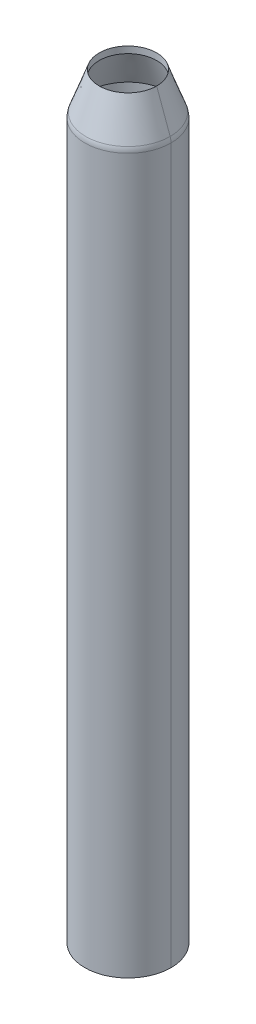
ISO-10303-21;
HEADER;
FILE_DESCRIPTION(('STEP AP214'),'2;1');
FILE_NAME('part.step','',(''),(''),'','','');
FILE_SCHEMA(('AUTOMOTIVE_DESIGN { 1 0 10303 214 1 1 1 1 }'));
ENDSEC;
DATA;
#1=APPLICATION_CONTEXT('core data for automotive mechanical design processes');
#2=APPLICATION_PROTOCOL_DEFINITION('international standard','automotive_design',2000,#1);
#3=PRODUCT_CONTEXT('',#1,'mechanical');
#4=PRODUCT('Part','Part','',(#3));
#5=PRODUCT_RELATED_PRODUCT_CATEGORY('part','',(#4));
#6=PRODUCT_DEFINITION_FORMATION('','',#4);
#7=PRODUCT_DEFINITION_CONTEXT('part definition',#1,'design');
#8=PRODUCT_DEFINITION('design','',#6,#7);
#9=PRODUCT_DEFINITION_SHAPE('','',#8);
#10=(LENGTH_UNIT() NAMED_UNIT(*) SI_UNIT(.MILLI.,.METRE.));
#11=(NAMED_UNIT(*) PLANE_ANGLE_UNIT() SI_UNIT($,.RADIAN.));
#12=(NAMED_UNIT(*) SI_UNIT($,.STERADIAN.) SOLID_ANGLE_UNIT());
#13=UNCERTAINTY_MEASURE_WITH_UNIT(LENGTH_MEASURE(1.E-05),#10,'distance_accuracy_value','');
#14=(GEOMETRIC_REPRESENTATION_CONTEXT(3) GLOBAL_UNCERTAINTY_ASSIGNED_CONTEXT((#13)) GLOBAL_UNIT_ASSIGNED_CONTEXT((#10,
#11,#12)) REPRESENTATION_CONTEXT('',''));
#15=CARTESIAN_POINT('',(0.,0.,0.));
#16=DIRECTION('',(0.,0.,1.));
#17=DIRECTION('',(1.,0.,0.));
#18=AXIS2_PLACEMENT_3D('',#15,#16,#17);
#19=CARTESIAN_POINT('',(0.,3115.53993403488,0.));
#20=DIRECTION('',(0.,1.,0.));
#21=DIRECTION('',(-1.,0.,0.));
#22=AXIS2_PLACEMENT_3D('',#19,#20,#21);
#23=CYLINDRICAL_SURFACE('',#22,57.);
#24=DIRECTION('',(0.,1.,0.));
#25=VECTOR('',#24,1.);
#26=CARTESIAN_POINT('',(40.0000000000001,3115.53993403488,-40.6078810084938));
#27=LINE('',#26,#25);
#28=CARTESIAN_POINT('',(40.0000000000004,850.,-40.6078810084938));
#29=VERTEX_POINT('',#28);
#30=CARTESIAN_POINT('',(40.0000000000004,530.,-40.6078810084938));
#31=VERTEX_POINT('',#30);
#32=EDGE_CURVE('E170',#29,#31,#27,.F.);
#33=ORIENTED_EDGE('',*,*,#32,.F.);
#34=CARTESIAN_POINT('',(-39.9999999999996,850.,-40.607881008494));
#35=CARTESIAN_POINT('',(-40.0000187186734,850.483392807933,-40.6078393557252));
#36=CARTESIAN_POINT('',(-39.9912379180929,850.966768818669,-40.616511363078));
#37=CARTESIAN_POINT('',(-39.9562189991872,851.932219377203,-40.6509737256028));
#38=CARTESIAN_POINT('',(-39.9299830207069,852.414294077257,-40.6767619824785));
#39=CARTESIAN_POINT('',(-39.8602501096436,853.375239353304,-40.7450944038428));
#40=CARTESIAN_POINT('',(-39.8167803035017,853.854113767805,-40.7876122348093));
#41=CARTESIAN_POINT('',(-39.7128568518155,854.808265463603,-40.8888030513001));
#42=CARTESIAN_POINT('',(-39.6524028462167,855.28354266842,-40.9474763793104));
#43=CARTESIAN_POINT('',(-39.4475653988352,856.691955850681,-41.1451803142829));
#44=CARTESIAN_POINT('',(-39.2789000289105,857.61858839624,-41.3067025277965));
#45=CARTESIAN_POINT('',(-38.8796024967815,859.447415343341,-41.6827454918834));
#46=CARTESIAN_POINT('',(-38.6489482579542,860.349600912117,-41.8972851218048));
#47=CARTESIAN_POINT('',(-38.1309075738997,862.119350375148,-42.369278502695));
#48=CARTESIAN_POINT('',(-37.8438853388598,862.987095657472,-42.6264551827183));
#49=CARTESIAN_POINT('',(-37.2155911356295,864.690964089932,-43.1760796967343));
#50=CARTESIAN_POINT('',(-36.8743227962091,865.527089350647,-43.4685251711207));
#51=CARTESIAN_POINT('',(-36.139339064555,867.168555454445,-44.0814901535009));
#52=CARTESIAN_POINT('',(-35.7454693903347,867.97379641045,-44.4020912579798));
#53=CARTESIAN_POINT('',(-34.9084548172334,869.549836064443,-45.0631142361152));
#54=CARTESIAN_POINT('',(-34.4653029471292,870.320629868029,-45.403538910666));
#55=CARTESIAN_POINT('',(-33.4500380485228,871.958566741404,-46.1580072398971));
#56=CARTESIAN_POINT('',(-32.8689226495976,872.819003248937,-46.5745186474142));
#57=CARTESIAN_POINT('',(-31.6437412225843,874.489729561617,-47.4154606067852));
#58=CARTESIAN_POINT('',(-30.9996706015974,875.300015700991,-47.839891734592));
#59=CARTESIAN_POINT('',(-29.6500849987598,876.869009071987,-48.6878615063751));
#60=CARTESIAN_POINT('',(-28.9445410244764,877.627691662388,-49.1113996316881));
#61=CARTESIAN_POINT('',(-27.4738156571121,879.090638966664,-49.949031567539));
#62=CARTESIAN_POINT('',(-26.7086301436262,879.794899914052,-50.363124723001));
#63=CARTESIAN_POINT('',(-24.9864198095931,881.259605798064,-51.2422113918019));
#64=CARTESIAN_POINT('',(-24.018788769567,882.009540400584,-51.7040334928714));
#65=CARTESIAN_POINT('',(-22.0071335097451,883.424506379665,-52.5917692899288));
#66=CARTESIAN_POINT('',(-20.9630951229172,884.089521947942,-53.0176762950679));
#67=CARTESIAN_POINT('',(-19.3446920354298,885.016697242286,-53.6200919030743));
#68=CARTESIAN_POINT('',(-18.7968250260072,885.31388262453,-53.8147230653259));
#69=CARTESIAN_POINT('',(-17.6841574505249,885.883995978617,-54.1905449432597));
#70=CARTESIAN_POINT('',(-17.1193593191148,886.156927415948,-54.3717375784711));
#71=CARTESIAN_POINT('',(-15.9738941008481,886.677381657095,-54.7192179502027));
#72=CARTESIAN_POINT('',(-15.3932315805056,886.924911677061,-54.8855099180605));
#73=CARTESIAN_POINT('',(-14.2170853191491,887.393518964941,-55.2018605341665));
#74=CARTESIAN_POINT('',(-13.6216029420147,887.614598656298,-55.3519206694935));
#75=CARTESIAN_POINT('',(-12.140578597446,888.124394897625,-55.6993746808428));
#76=CARTESIAN_POINT('',(-11.2472931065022,888.39761270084,-55.8869021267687));
#77=CARTESIAN_POINT('',(-9.43677619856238,888.882198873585,-56.2209445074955));
#78=CARTESIAN_POINT('',(-8.51954905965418,889.093578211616,-56.3674667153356));
#79=CARTESIAN_POINT('',(-6.6672418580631,889.451704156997,-56.6164320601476));
#80=CARTESIAN_POINT('',(-5.73217395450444,889.598493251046,-56.7189041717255));
#81=CARTESIAN_POINT('',(-3.85005162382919,889.825564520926,-56.8776668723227));
#82=CARTESIAN_POINT('',(-2.90299679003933,889.905844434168,-56.9339558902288));
#83=CARTESIAN_POINT('',(-1.00204992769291,889.998790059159,-56.9991412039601));
#84=CARTESIAN_POINT('',(-0.048148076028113,890.011321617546,-57.0079434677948));
#85=CARTESIAN_POINT('',(1.8573422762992,889.968218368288,-56.9776995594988));
#86=CARTESIAN_POINT('',(2.80893078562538,889.912583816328,-56.9386535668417));
#87=CARTESIAN_POINT('',(4.70284822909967,889.733967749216,-56.8135911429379));
#88=CARTESIAN_POINT('',(5.64517492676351,889.610970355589,-56.7275636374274));
#89=CARTESIAN_POINT('',(7.51360958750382,889.299398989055,-56.5104440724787));
#90=CARTESIAN_POINT('',(8.4397175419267,889.110824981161,-56.3793519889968));
#91=CARTESIAN_POINT('',(10.2483153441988,888.67579277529,-56.0784529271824));
#92=CARTESIAN_POINT('',(11.1313187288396,888.430787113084,-55.9096201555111));
#93=CARTESIAN_POINT('',(12.8712494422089,887.883541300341,-55.5348804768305));
#94=CARTESIAN_POINT('',(13.7281773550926,887.581302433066,-55.3289744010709));
#95=CARTESIAN_POINT('',(15.4120264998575,886.922714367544,-54.8837676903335));
#96=CARTESIAN_POINT('',(16.2389459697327,886.566361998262,-54.6444650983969));
#97=CARTESIAN_POINT('',(17.8595627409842,885.802773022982,-54.1364693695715));
#98=CARTESIAN_POINT('',(18.6532580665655,885.395533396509,-53.8677744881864));
#99=CARTESIAN_POINT('',(20.291959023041,884.484935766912,-53.2736209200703));
#100=CARTESIAN_POINT('',(21.1327384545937,883.975920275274,-52.9451756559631));
#101=CARTESIAN_POINT('',(22.7675461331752,882.902813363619,-52.2630227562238));
#102=CARTESIAN_POINT('',(23.5615714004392,882.338718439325,-51.9093135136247));
#103=CARTESIAN_POINT('',(25.1016839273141,881.158427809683,-51.1823330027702));
#104=CARTESIAN_POINT('',(25.8477260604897,880.542184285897,-50.8090439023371));
#105=CARTESIAN_POINT('',(27.2896186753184,879.261014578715,-50.0493845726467));
#106=CARTESIAN_POINT('',(27.9854667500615,878.596086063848,-49.6630137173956));
#107=CARTESIAN_POINT('',(29.4459124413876,877.096520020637,-48.813663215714));
#108=CARTESIAN_POINT('',(30.2004737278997,876.252827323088,-48.3493663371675));
#109=CARTESIAN_POINT('',(31.6360612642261,874.50387607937,-47.4224611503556));
#110=CARTESIAN_POINT('',(32.31707224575,873.598604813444,-46.9598532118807));
#111=CARTESIAN_POINT('',(33.6029282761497,871.728578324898,-46.0484987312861));
#112=CARTESIAN_POINT('',(34.2077604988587,870.763813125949,-45.5997545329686));
#113=CARTESIAN_POINT('',(35.3374609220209,868.776826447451,-44.7299868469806));
#114=CARTESIAN_POINT('',(35.8623544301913,867.754623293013,-44.3089546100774));
#115=CARTESIAN_POINT('',(36.7162835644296,865.8967089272,-43.6021477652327));
#116=CARTESIAN_POINT('',(37.0625860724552,865.072263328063,-43.3075538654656));
#117=CARTESIAN_POINT('',(37.7022934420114,863.391973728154,-42.751802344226));
#118=CARTESIAN_POINT('',(37.9956986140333,862.536129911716,-42.4906445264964));
#119=CARTESIAN_POINT('',(38.525455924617,860.798670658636,-42.0109111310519));
#120=CARTESIAN_POINT('',(38.7620006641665,859.917153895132,-41.7921923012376));
#121=CARTESIAN_POINT('',(39.1758641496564,858.129708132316,-41.4044977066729));
#122=CARTESIAN_POINT('',(39.3532081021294,857.22378970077,-41.2355007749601));
#123=CARTESIAN_POINT('',(39.5818880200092,855.792080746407,-41.0156922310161));
#124=CARTESIAN_POINT('',(39.6544674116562,855.272531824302,-40.945460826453));
#125=CARTESIAN_POINT('',(39.7793024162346,854.228847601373,-40.8241925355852));
#126=CARTESIAN_POINT('',(39.8315627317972,853.704713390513,-40.7731512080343));
#127=CARTESIAN_POINT('',(39.9155352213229,852.651415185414,-40.6909535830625));
#128=CARTESIAN_POINT('',(39.9471758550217,852.122240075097,-40.6598665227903));
#129=CARTESIAN_POINT('',(39.9894258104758,851.062051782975,-40.6182960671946));
#130=CARTESIAN_POINT('',(40.0000273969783,850.53103799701,-40.6078202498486));
#131=CARTESIAN_POINT('',(40.0000000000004,850.,-40.6078810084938));
#132=B_SPLINE_CURVE_WITH_KNOTS('',3,(#34,#35,#36,#37,#38,#39,#40,#41,#42,#43,#44,#45,#46,#47,
#48,#49,#50,#51,#52,#53,#54,#55,#56,#57,#58,#59,#60,#61,#62,#63,#64,#65,#66,#67,#68,#69,#70,#71,
#72,#73,#74,#75,#76,#77,#78,#79,#80,#81,#82,#83,#84,#85,#86,#87,#88,#89,#90,#91,#92,#93,#94,#95,
#96,#97,#98,#99,#100,#101,#102,#103,#104,#105,#106,#107,#108,#109,#110,#111,#112,#113,#114,#115,
#116,#117,#118,#119,#120,#121,#122,#123,#124,#125,#126,#127,#128,#129,#130,#131),.UNSPECIFIED.,
.F.,.F.,(4,2,2,2,2,2,2,2,2,2,2,2,2,2,2,2,2,2,2,2,2,2,2,2,2,2,2,2,2,2,2,2,2,2,2,2,2,2,2,2,2,2,2,
2,2,2,2,2,4),(0.,1.44999242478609,2.89980712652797,4.34734878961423,5.79492114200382,
8.65728056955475,11.5206607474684,14.3661148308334,17.2113786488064,20.065178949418,
22.9193834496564,26.2724497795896,29.6257609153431,32.9806622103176,36.3357954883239,
40.2559312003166,44.1767956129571,46.1350119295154,48.0929479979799,50.0503262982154,
52.0075251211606,54.8625974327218,57.7171630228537,60.569848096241,63.4226302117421,
66.2810592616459,69.1394775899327,71.9985699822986,74.8576639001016,77.6500783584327,
80.442430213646,83.2349457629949,86.0276271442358,89.1334603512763,92.2394912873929,
95.3484018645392,98.4574614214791,102.123849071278,105.790996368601,109.458760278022,
113.12536058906,115.947555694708,118.769734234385,121.582214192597,124.393495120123,
125.980665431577,127.567468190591,129.159747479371,130.752612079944),.UNSPECIFIED.);
#133=CARTESIAN_POINT('',(-39.9999999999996,850.,-40.607881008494));
#134=VERTEX_POINT('',#133);
#135=EDGE_CURVE('E164',#134,#29,#132,.T.);
#136=ORIENTED_EDGE('',*,*,#135,.F.);
#137=DIRECTION('',(0.,1.,0.));
#138=VECTOR('',#137,1.);
#139=CARTESIAN_POINT('',(-39.9999999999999,3115.53993403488,-40.607881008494));
#140=LINE('',#139,#138);
#141=CARTESIAN_POINT('',(-39.9999999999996,530.,-40.607881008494));
#142=VERTEX_POINT('',#141);
#143=EDGE_CURVE('E122',#142,#134,#140,.T.);
#144=ORIENTED_EDGE('',*,*,#143,.F.);
#145=CARTESIAN_POINT('',(40.0000000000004,530.,-40.6078810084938));
#146=CARTESIAN_POINT('',(40.0000187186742,529.516607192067,-40.607839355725));
#147=CARTESIAN_POINT('',(39.9912379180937,529.033231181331,-40.6165113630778));
#148=CARTESIAN_POINT('',(39.9562189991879,528.067780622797,-40.6509737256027));
#149=CARTESIAN_POINT('',(39.9299830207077,527.585705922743,-40.6767619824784));
#150=CARTESIAN_POINT('',(39.8602501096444,526.624760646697,-40.7450944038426));
#151=CARTESIAN_POINT('',(39.8167803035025,526.145886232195,-40.7876122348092));
#152=CARTESIAN_POINT('',(39.7128568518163,525.191734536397,-40.8888030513));
#153=CARTESIAN_POINT('',(39.6524028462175,524.71645733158,-40.9474763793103));
#154=CARTESIAN_POINT('',(39.447565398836,523.30804414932,-41.1451803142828));
#155=CARTESIAN_POINT('',(39.2789000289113,522.38141160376,-41.3067025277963));
#156=CARTESIAN_POINT('',(38.8796024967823,520.552584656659,-41.6827454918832));
#157=CARTESIAN_POINT('',(38.648948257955,519.650399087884,-41.8972851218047));
#158=CARTESIAN_POINT('',(38.1309075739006,517.880649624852,-42.3692785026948));
#159=CARTESIAN_POINT('',(37.8438853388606,517.012904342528,-42.6264551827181));
#160=CARTESIAN_POINT('',(37.2155911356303,515.309035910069,-43.1760796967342));
#161=CARTESIAN_POINT('',(36.8743227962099,514.472910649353,-43.4685251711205));
#162=CARTESIAN_POINT('',(36.1393390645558,512.831444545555,-44.0814901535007));
#163=CARTESIAN_POINT('',(35.7454693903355,512.026203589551,-44.4020912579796));
#164=CARTESIAN_POINT('',(34.9084548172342,510.450163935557,-45.063114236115));
#165=CARTESIAN_POINT('',(34.4653029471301,509.679370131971,-45.4035389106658));
#166=CARTESIAN_POINT('',(33.4500380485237,508.041433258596,-46.1580072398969));
#167=CARTESIAN_POINT('',(32.8689226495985,507.180996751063,-46.574518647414));
#168=CARTESIAN_POINT('',(31.6437412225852,505.510270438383,-47.415460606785));
#169=CARTESIAN_POINT('',(30.9996706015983,504.699984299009,-47.8398917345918));
#170=CARTESIAN_POINT('',(29.6500849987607,503.130990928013,-48.6878615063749));
#171=CARTESIAN_POINT('',(28.9445410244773,502.372308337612,-49.111399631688));
#172=CARTESIAN_POINT('',(27.4738156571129,500.909361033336,-49.9490315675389));
#173=CARTESIAN_POINT('',(26.7086301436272,500.205100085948,-50.3631247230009));
#174=CARTESIAN_POINT('',(24.9864198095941,498.740394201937,-51.2422113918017));
#175=CARTESIAN_POINT('',(24.018788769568,497.990459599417,-51.7040334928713));
#176=CARTESIAN_POINT('',(22.007133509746,496.575493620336,-52.5917692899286));
#177=CARTESIAN_POINT('',(20.9630951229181,495.910478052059,-53.0176762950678));
#178=CARTESIAN_POINT('',(19.3446920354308,494.983302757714,-53.6200919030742));
#179=CARTESIAN_POINT('',(18.7968250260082,494.686117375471,-53.8147230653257));
#180=CARTESIAN_POINT('',(17.6841574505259,494.116004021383,-54.1905449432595));
#181=CARTESIAN_POINT('',(17.1193593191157,493.843072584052,-54.371737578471));
#182=CARTESIAN_POINT('',(15.9738941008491,493.322618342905,-54.7192179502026));
#183=CARTESIAN_POINT('',(15.3932315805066,493.075088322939,-54.8855099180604));
#184=CARTESIAN_POINT('',(14.2170853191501,492.606481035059,-55.2018605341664));
#185=CARTESIAN_POINT('',(13.6216029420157,492.385401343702,-55.3519206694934));
#186=CARTESIAN_POINT('',(12.1405785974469,491.875605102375,-55.6993746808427));
#187=CARTESIAN_POINT('',(11.2472931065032,491.60238729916,-55.8869021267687));
#188=CARTESIAN_POINT('',(9.43677619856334,491.117801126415,-56.2209445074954));
#189=CARTESIAN_POINT('',(8.51954905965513,490.906421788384,-56.3674667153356));
#190=CARTESIAN_POINT('',(6.66724185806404,490.548295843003,-56.6164320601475));
#191=CARTESIAN_POINT('',(5.73217395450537,490.401506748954,-56.7189041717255));
#192=CARTESIAN_POINT('',(3.85005162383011,490.174435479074,-56.8776668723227));
#193=CARTESIAN_POINT('',(2.90299679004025,490.094155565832,-56.9339558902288));
#194=CARTESIAN_POINT('',(1.00204992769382,490.001209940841,-56.9991412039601));
#195=CARTESIAN_POINT('',(0.0481480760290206,489.988678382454,-57.0079434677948));
#196=CARTESIAN_POINT('',(-1.85734227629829,490.031781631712,-56.9776995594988));
#197=CARTESIAN_POINT('',(-2.80893078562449,490.087416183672,-56.9386535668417));
#198=CARTESIAN_POINT('',(-4.70284822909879,490.266032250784,-56.8135911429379));
#199=CARTESIAN_POINT('',(-5.64517492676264,490.389029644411,-56.7275636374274));
#200=CARTESIAN_POINT('',(-7.51360958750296,490.700601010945,-56.5104440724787));
#201=CARTESIAN_POINT('',(-8.43971754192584,490.889175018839,-56.3793519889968));
#202=CARTESIAN_POINT('',(-10.2483153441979,491.32420722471,-56.0784529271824));
#203=CARTESIAN_POINT('',(-11.1313187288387,491.569212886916,-55.9096201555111));
#204=CARTESIAN_POINT('',(-12.8712494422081,492.116458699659,-55.5348804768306));
#205=CARTESIAN_POINT('',(-13.7281773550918,492.418697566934,-55.3289744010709));
#206=CARTESIAN_POINT('',(-15.4120264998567,493.077285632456,-54.8837676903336));
#207=CARTESIAN_POINT('',(-16.2389459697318,493.433638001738,-54.644465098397));
#208=CARTESIAN_POINT('',(-17.8595627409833,494.197226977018,-54.1364693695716));
#209=CARTESIAN_POINT('',(-18.6532580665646,494.604466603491,-53.8677744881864));
#210=CARTESIAN_POINT('',(-20.2919590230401,495.515064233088,-53.2736209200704));
#211=CARTESIAN_POINT('',(-21.1327384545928,496.024079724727,-52.9451756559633));
#212=CARTESIAN_POINT('',(-22.7675461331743,497.097186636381,-52.2630227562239));
#213=CARTESIAN_POINT('',(-23.5615714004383,497.661281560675,-51.9093135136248));
#214=CARTESIAN_POINT('',(-25.1016839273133,498.841572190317,-51.1823330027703));
#215=CARTESIAN_POINT('',(-25.8477260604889,499.457815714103,-50.8090439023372));
#216=CARTESIAN_POINT('',(-27.2896186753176,500.738985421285,-50.0493845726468));
#217=CARTESIAN_POINT('',(-27.9854667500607,501.403913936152,-49.6630137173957));
#218=CARTESIAN_POINT('',(-29.4459124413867,502.903479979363,-48.8136632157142));
#219=CARTESIAN_POINT('',(-30.2004737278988,503.747172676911,-48.3493663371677));
#220=CARTESIAN_POINT('',(-31.6360612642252,505.49612392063,-47.4224611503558));
#221=CARTESIAN_POINT('',(-32.3170722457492,506.401395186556,-46.9598532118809));
#222=CARTESIAN_POINT('',(-33.6029282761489,508.271421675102,-46.0484987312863));
#223=CARTESIAN_POINT('',(-34.2077604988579,509.236186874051,-45.5997545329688));
#224=CARTESIAN_POINT('',(-35.33746092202,511.223173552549,-44.7299868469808));
#225=CARTESIAN_POINT('',(-35.8623544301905,512.245376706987,-44.3089546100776));
#226=CARTESIAN_POINT('',(-36.7162835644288,514.1032910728,-43.6021477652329));
#227=CARTESIAN_POINT('',(-37.0625860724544,514.927736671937,-43.3075538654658));
#228=CARTESIAN_POINT('',(-37.7022934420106,516.608026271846,-42.7518023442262));
#229=CARTESIAN_POINT('',(-37.9956986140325,517.463870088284,-42.4906445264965));
#230=CARTESIAN_POINT('',(-38.5254559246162,519.201329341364,-42.0109111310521));
#231=CARTESIAN_POINT('',(-38.7620006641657,520.082846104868,-41.7921923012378));
#232=CARTESIAN_POINT('',(-39.1758641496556,521.870291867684,-41.4044977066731));
#233=CARTESIAN_POINT('',(-39.3532081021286,522.77621029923,-41.2355007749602));
#234=CARTESIAN_POINT('',(-39.5818880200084,524.207919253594,-41.0156922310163));
#235=CARTESIAN_POINT('',(-39.6544674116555,524.727468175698,-40.9454608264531));
#236=CARTESIAN_POINT('',(-39.7793024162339,525.771152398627,-40.8241925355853));
#237=CARTESIAN_POINT('',(-39.8315627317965,526.295286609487,-40.7731512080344));
#238=CARTESIAN_POINT('',(-39.9155352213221,527.348584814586,-40.6909535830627));
#239=CARTESIAN_POINT('',(-39.947175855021,527.877759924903,-40.6598665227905));
#240=CARTESIAN_POINT('',(-39.989425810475,528.937948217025,-40.6182960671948));
#241=CARTESIAN_POINT('',(-40.0000273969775,529.46896200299,-40.6078202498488));
#242=CARTESIAN_POINT('',(-39.9999999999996,530.,-40.6078810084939));
#243=B_SPLINE_CURVE_WITH_KNOTS('',3,(#145,#146,#147,#148,#149,#150,#151,#152,#153,#154,#155,
#156,#157,#158,#159,#160,#161,#162,#163,#164,#165,#166,#167,#168,#169,#170,#171,#172,#173,#174,
#175,#176,#177,#178,#179,#180,#181,#182,#183,#184,#185,#186,#187,#188,#189,#190,#191,#192,#193,
#194,#195,#196,#197,#198,#199,#200,#201,#202,#203,#204,#205,#206,#207,#208,#209,#210,#211,#212,
#213,#214,#215,#216,#217,#218,#219,#220,#221,#222,#223,#224,#225,#226,#227,#228,#229,#230,#231,
#232,#233,#234,#235,#236,#237,#238,#239,#240,#241,#242),.UNSPECIFIED.,.F.,.F.,(4,2,2,2,2,2,2,2,
2,2,2,2,2,2,2,2,2,2,2,2,2,2,2,2,2,2,2,2,2,2,2,2,2,2,2,2,2,2,2,2,2,2,2,2,2,2,2,2,4),(0.,
1.44999242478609,2.89980712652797,4.34734878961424,5.79492114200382,8.65728056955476,
11.5206607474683,14.3661148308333,17.2113786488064,20.0651789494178,22.9193834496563,
26.2724497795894,29.625760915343,32.9806622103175,36.3357954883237,40.2559312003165,
44.1767956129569,46.1350119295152,48.0929479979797,50.0503262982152,52.0075251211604,
54.8625974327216,57.7171630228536,60.5698480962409,63.422630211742,66.2810592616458,
69.1394775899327,71.9985699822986,74.8576639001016,77.6500783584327,80.4424302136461,
83.2349457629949,86.0276271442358,89.1334603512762,92.2394912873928,95.3484018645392,
98.457461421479,102.123849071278,105.790996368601,109.458760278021,113.12536058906,
115.947555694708,118.769734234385,121.582214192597,124.393495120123,125.980665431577,
127.567468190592,129.159747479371,130.752612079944),.UNSPECIFIED.);
#244=EDGE_CURVE('E109',#31,#142,#243,.T.);
#245=ORIENTED_EDGE('',*,*,#244,.F.);
#246=EDGE_LOOP('',(#33,#136,#144,#245));
#247=FACE_BOUND('',#246,.T.);
#248=CARTESIAN_POINT('',(3.8370938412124E-13,0.,0.));
#249=DIRECTION('',(0.,1.,0.));
#250=DIRECTION('',(-1.,0.,0.));
#251=AXIS2_PLACEMENT_3D('',#248,#249,#250);
#252=CIRCLE('',#251,56.9999999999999);
#253=CARTESIAN_POINT('',(57.0000000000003,0.,0.));
#254=VERTEX_POINT('',#253);
#255=CARTESIAN_POINT('',(-56.9999999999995,0.,0.));
#256=VERTEX_POINT('',#255);
#257=EDGE_CURVE('E184',#254,#256,#252,.T.);
#258=ORIENTED_EDGE('',*,*,#257,.T.);
#259=DIRECTION('',(0.,1.,0.));
#260=VECTOR('',#259,1.);
#261=CARTESIAN_POINT('',(-57.,3115.53993403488,0.));
#262=LINE('',#261,#260);
#263=CARTESIAN_POINT('',(-56.9999999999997,944.271389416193,0.));
#264=VERTEX_POINT('',#263);
#265=EDGE_CURVE('E11',#256,#264,#262,.T.);
#266=ORIENTED_EDGE('',*,*,#265,.T.);
#267=CARTESIAN_POINT('',(2.67413075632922E-13,944.271389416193,0.));
#268=DIRECTION('',(0.,-1.,0.));
#269=DIRECTION('',(1.,0.,0.));
#270=AXIS2_PLACEMENT_3D('',#267,#268,#269);
#271=CIRCLE('',#270,57.);
#272=CARTESIAN_POINT('',(57.0000000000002,944.271389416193,0.));
#273=VERTEX_POINT('',#272);
#274=EDGE_CURVE('E195',#264,#273,#271,.T.);
#275=ORIENTED_EDGE('',*,*,#274,.T.);
#276=DIRECTION('',(0.,-1.,0.));
#277=VECTOR('',#276,1.);
#278=CARTESIAN_POINT('',(57.,3115.53993403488,0.));
#279=LINE('',#278,#277);
#280=EDGE_CURVE('E49',#273,#254,#279,.T.);
#281=ORIENTED_EDGE('',*,*,#280,.T.);
#282=EDGE_LOOP('',(#258,#266,#275,#281));
#283=FACE_BOUND('',#282,.T.);
#284=ADVANCED_FACE('F40',(#247,#283),#23,.T.);
#285=CARTESIAN_POINT('',(2.67413075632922E-13,944.271389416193,0.));
#286=DIRECTION('',(0.,-1.,0.));
#287=DIRECTION('',(1.,0.,0.));
#288=AXIS2_PLACEMENT_3D('',#285,#286,#287);
#289=TOROIDAL_SURFACE('',#288,37.,20.);
#290=ORIENTED_EDGE('',*,*,#274,.F.);
#291=CARTESIAN_POINT('',(-36.9999999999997,944.271389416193,0.));
#292=DIRECTION('',(0.,0.,1.));
#293=DIRECTION('',(1.,0.,0.));
#294=AXIS2_PLACEMENT_3D('',#291,#292,#293);
#295=CIRCLE('',#294,20.);
#296=CARTESIAN_POINT('',(-55.7938524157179,951.111792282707,0.));
#297=VERTEX_POINT('',#296);
#298=EDGE_CURVE('E210',#264,#297,#295,.F.);
#299=ORIENTED_EDGE('',*,*,#298,.T.);
#300=CARTESIAN_POINT('',(2.66570612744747E-13,951.111792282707,0.));
#301=DIRECTION('',(0.,1.,0.));
#302=DIRECTION('',(-1.,0.,0.));
#303=AXIS2_PLACEMENT_3D('',#300,#301,#302);
#304=CIRCLE('',#303,55.7938524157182);
#305=CARTESIAN_POINT('',(55.7938524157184,951.111792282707,0.));
#306=VERTEX_POINT('',#305);
#307=EDGE_CURVE('E191',#306,#297,#304,.T.);
#308=ORIENTED_EDGE('',*,*,#307,.F.);
#309=CARTESIAN_POINT('',(37.0000000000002,944.271389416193,0.));
#310=DIRECTION('',(0.,0.,1.));
#311=DIRECTION('',(1.,0.,0.));
#312=AXIS2_PLACEMENT_3D('',#309,#310,#311);
#313=CIRCLE('',#312,20.);
#314=EDGE_CURVE('E206',#306,#273,#313,.F.);
#315=ORIENTED_EDGE('',*,*,#314,.T.);
#316=EDGE_LOOP('',(#290,#299,#308,#315));
#317=FACE_BOUND('',#316,.T.);
#318=ADVANCED_FACE('F248',(#317),#289,.T.);
#319=CARTESIAN_POINT('',(2.66978747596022E-13,947.797929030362,0.));
#320=DIRECTION('',(0.,-1.,0.));
#321=DIRECTION('',(1.,0.,0.));
#322=AXIS2_PLACEMENT_3D('',#319,#320,#321);
#323=CONICAL_SURFACE('',#322,57.,0.349065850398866);
#324=CARTESIAN_POINT('',(2.60549549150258E-13,1000.,0.));
#325=DIRECTION('',(0.,1.,0.));
#326=DIRECTION('',(-1.,0.,0.));
#327=AXIS2_PLACEMENT_3D('',#324,#325,#326);
#328=CIRCLE('',#327,38.0000000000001);
#329=CARTESIAN_POINT('',(38.0000000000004,1000.,0.));
#330=VERTEX_POINT('',#329);
#331=CARTESIAN_POINT('',(-37.9999999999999,1000.,0.));
#332=VERTEX_POINT('',#331);
#333=EDGE_CURVE('E187',#330,#332,#328,.T.);
#334=ORIENTED_EDGE('',*,*,#333,.F.);
#335=DIRECTION('',(0.342020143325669,-0.939692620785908,0.));
#336=VECTOR('',#335,1.);
#337=CARTESIAN_POINT('',(57.0000000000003,947.797929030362,0.));
#338=LINE('',#337,#336);
#339=EDGE_CURVE('E202',#330,#306,#338,.T.);
#340=ORIENTED_EDGE('',*,*,#339,.T.);
#341=ORIENTED_EDGE('',*,*,#307,.T.);
#342=DIRECTION('',(0.342020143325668,0.939692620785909,0.));
#343=VECTOR('',#342,1.);
#344=CARTESIAN_POINT('',(-56.9999999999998,947.797929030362,0.));
#345=LINE('',#344,#343);
#346=EDGE_CURVE('E198',#297,#332,#345,.T.);
#347=ORIENTED_EDGE('',*,*,#346,.T.);
#348=EDGE_LOOP('',(#334,#340,#341,#347));
#349=FACE_BOUND('',#348,.T.);
#350=ADVANCED_FACE('F238',(#349),#323,.T.);
#351=CARTESIAN_POINT('',(0.,3115.53993403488,0.));
#352=DIRECTION('',(0.,1.,0.));
#353=DIRECTION('',(-1.,0.,0.));
#354=AXIS2_PLACEMENT_3D('',#351,#352,#353);
#355=CYLINDRICAL_SURFACE('',#354,38.0000000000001);
#356=CARTESIAN_POINT('',(2.61629834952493E-13,991.228586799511,0.));
#357=DIRECTION('',(0.,1.,0.));
#358=DIRECTION('',(-1.,0.,0.));
#359=AXIS2_PLACEMENT_3D('',#356,#357,#358);
#360=CIRCLE('',#359,38.0000000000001);
#361=CARTESIAN_POINT('',(-37.9999999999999,991.228586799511,0.));
#362=VERTEX_POINT('',#361);
#363=EDGE_CURVE('E175',#362,#362,#360,.T.);
#364=ORIENTED_EDGE('',*,*,#363,.F.);
#365=EDGE_LOOP('',(#364));
#366=FACE_BOUND('',#365,.T.);
#367=EDGE_CURVE('E188',#332,#330,#328,.T.);
#368=ORIENTED_EDGE('',*,*,#367,.T.);
#369=ORIENTED_EDGE('',*,*,#333,.T.);
#370=EDGE_LOOP('',(#368,#369));
#371=FACE_BOUND('',#370,.T.);
#372=ADVANCED_FACE('F234',(#366,#371),#355,.F.);
#373=ORIENTED_EDGE('',*,*,#339,.F.);
#374=ORIENTED_EDGE('',*,*,#367,.F.);
#375=ORIENTED_EDGE('',*,*,#346,.F.);
#376=EDGE_CURVE('E192',#297,#306,#304,.T.);
#377=ORIENTED_EDGE('',*,*,#376,.T.);
#378=EDGE_LOOP('',(#373,#374,#375,#377));
#379=FACE_BOUND('',#378,.T.);
#380=ADVANCED_FACE('F237',(#379),#323,.T.);
#381=ORIENTED_EDGE('',*,*,#265,.F.);
#382=EDGE_CURVE('E58',#256,#254,#252,.T.);
#383=ORIENTED_EDGE('',*,*,#382,.T.);
#384=ORIENTED_EDGE('',*,*,#280,.F.);
#385=EDGE_CURVE('E196',#273,#264,#271,.T.);
#386=ORIENTED_EDGE('',*,*,#385,.T.);
#387=EDGE_LOOP('',(#381,#383,#384,#386));
#388=FACE_BOUND('',#387,.T.);
#389=ADVANCED_FACE('F223',(#388),#23,.T.);
#390=CARTESIAN_POINT('',(57.0000000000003,0.,0.));
#391=DIRECTION('',(0.,1.,0.));
#392=DIRECTION('',(-1.,0.,0.));
#393=AXIS2_PLACEMENT_3D('',#390,#391,#392);
#394=PLANE('',#393);
#395=ORIENTED_EDGE('',*,*,#257,.F.);
#396=ORIENTED_EDGE('',*,*,#382,.F.);
#397=EDGE_LOOP('',(#395,#396));
#398=FACE_BOUND('',#397,.T.);
#399=CARTESIAN_POINT('',(3.8370938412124E-13,0.,0.));
#400=DIRECTION('',(0.,1.,0.));
#401=DIRECTION('',(-1.,0.,0.));
#402=AXIS2_PLACEMENT_3D('',#399,#400,#401);
#403=CIRCLE('',#402,53.9999999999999);
#404=CARTESIAN_POINT('',(-53.9999999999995,0.,0.));
#405=VERTEX_POINT('',#404);
#406=EDGE_CURVE('E181',#405,#405,#403,.T.);
#407=ORIENTED_EDGE('',*,*,#406,.T.);
#408=EDGE_LOOP('',(#407));
#409=FACE_BOUND('',#408,.T.);
#410=ADVANCED_FACE('F220',(#398,#409),#394,.F.);
#411=CARTESIAN_POINT('',(0.,3115.53993403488,0.));
#412=DIRECTION('',(0.,1.,0.));
#413=DIRECTION('',(-1.,0.,0.));
#414=AXIS2_PLACEMENT_3D('',#411,#412,#413);
#415=CYLINDRICAL_SURFACE('',#414,54.);
#416=DIRECTION('',(0.,1.,0.));
#417=VECTOR('',#416,1.);
#418=CARTESIAN_POINT('',(-39.9999999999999,3115.53993403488,-36.2767142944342));
#419=LINE('',#418,#417);
#420=CARTESIAN_POINT('',(-39.9999999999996,850.,-36.2767142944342));
#421=VERTEX_POINT('',#420);
#422=CARTESIAN_POINT('',(-39.9999999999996,530.,-36.2767142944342));
#423=VERTEX_POINT('',#422);
#424=EDGE_CURVE('E118',#421,#423,#419,.F.);
#425=ORIENTED_EDGE('',*,*,#424,.F.);
#426=CARTESIAN_POINT('',(40.0000000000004,850.,-36.2767142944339));
#427=CARTESIAN_POINT('',(40.0000207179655,850.473687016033,-36.2766645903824));
#428=CARTESIAN_POINT('',(39.9915863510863,850.947353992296,-36.2859908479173));
#429=CARTESIAN_POINT('',(39.9579644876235,851.893301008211,-36.3230259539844));
#430=CARTESIAN_POINT('',(39.9327796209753,852.3655812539,-36.3507319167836));
#431=CARTESIAN_POINT('',(39.8658784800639,853.306646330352,-36.4240862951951));
#432=CARTESIAN_POINT('',(39.8241942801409,853.775436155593,-36.4696998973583));
#433=CARTESIAN_POINT('',(39.7245963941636,854.709250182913,-36.5781604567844));
#434=CARTESIAN_POINT('',(39.6666822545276,855.174274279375,-36.6410078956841));
#435=CARTESIAN_POINT('',(39.4707656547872,856.55052914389,-36.8523505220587));
#436=CARTESIAN_POINT('',(39.3097131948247,857.455007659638,-37.0246287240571));
#437=CARTESIAN_POINT('',(38.9290721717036,859.239077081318,-37.4246322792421));
#438=CARTESIAN_POINT('',(38.7094571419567,860.118656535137,-37.652382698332));
#439=CARTESIAN_POINT('',(38.217311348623,861.842043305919,-38.1517880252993));
#440=CARTESIAN_POINT('',(37.9452014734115,862.686074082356,-38.423091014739));
#441=CARTESIAN_POINT('',(37.3503546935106,864.343154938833,-39.0015770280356));
#442=CARTESIAN_POINT('',(37.0276224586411,865.156207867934,-39.3087567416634));
#443=CARTESIAN_POINT('',(36.3331078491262,866.753089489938,-39.9515943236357));
#444=CARTESIAN_POINT('',(35.9611610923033,867.536808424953,-40.2873462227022));
#445=CARTESIAN_POINT('',(35.17125861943,869.071645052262,-40.9787528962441));
#446=CARTESIAN_POINT('',(34.7532959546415,869.822757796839,-41.3344106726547));
#447=CARTESIAN_POINT('',(33.7846568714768,871.439557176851,-42.1315227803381));
#448=CARTESIAN_POINT('',(33.2241843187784,872.297963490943,-42.5758642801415));
#449=CARTESIAN_POINT('',(32.0414501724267,873.966460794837,-43.4729413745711));
#450=CARTESIAN_POINT('',(31.4191837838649,874.776548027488,-43.9256776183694));
#451=CARTESIAN_POINT('',(30.1140009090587,876.347489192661,-44.8305457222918));
#452=CARTESIAN_POINT('',(29.4310551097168,877.108319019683,-45.282677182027));
#453=CARTESIAN_POINT('',(28.0058869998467,878.578283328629,-46.1776840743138));
#454=CARTESIAN_POINT('',(27.2636599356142,879.287413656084,-46.6205587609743));
#455=CARTESIAN_POINT('',(25.5686410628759,880.785786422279,-47.5748683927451));
#456=CARTESIAN_POINT('',(24.6032145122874,881.56318976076,-48.0825687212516));
#457=CARTESIAN_POINT('',(22.591082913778,883.033236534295,-49.0601010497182));
#458=CARTESIAN_POINT('',(21.5443602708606,883.725861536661,-49.5299248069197));
#459=CARTESIAN_POINT('',(19.917965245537,884.693979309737,-50.1957938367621));
#460=CARTESIAN_POINT('',(19.3668369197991,885.004697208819,-50.4111409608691));
#461=CARTESIAN_POINT('',(18.2461904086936,885.601677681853,-50.8274888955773));
#462=CARTESIAN_POINT('',(17.6766733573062,885.887941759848,-51.0284905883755));
#463=CARTESIAN_POINT('',(16.5204790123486,886.434632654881,-51.4144436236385));
#464=CARTESIAN_POINT('',(15.93381146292,886.695073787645,-51.5994038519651));
#465=CARTESIAN_POINT('',(14.7439936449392,887.189107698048,-51.9518987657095));
#466=CARTESIAN_POINT('',(14.1408394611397,887.422694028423,-52.1194292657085));
#467=CARTESIAN_POINT('',(12.6701463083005,887.951313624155,-52.5000579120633));
#468=CARTESIAN_POINT('',(11.795159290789,888.232523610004,-52.7038528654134));
#469=CARTESIAN_POINT('',(10.0199170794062,888.735667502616,-53.0699739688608));
#470=CARTESIAN_POINT('',(9.1196678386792,888.957615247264,-53.2323097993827));
#471=CARTESIAN_POINT('',(7.75481333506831,889.243841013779,-53.4422579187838));
#472=CARTESIAN_POINT('',(7.29753258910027,889.33145530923,-53.5066393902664));
#473=CARTESIAN_POINT('',(6.37885071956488,889.490854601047,-53.623918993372));
#474=CARTESIAN_POINT('',(5.91745037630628,889.562642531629,-53.6768192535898));
#475=CARTESIAN_POINT('',(4.5280340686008,889.753873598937,-53.8178675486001));
#476=CARTESIAN_POINT('',(3.59471361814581,889.8492027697,-53.8883768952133));
#477=CARTESIAN_POINT('',(1.71904107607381,889.974127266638,-53.9808217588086));
#478=CARTESIAN_POINT('',(0.776672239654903,890.003557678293,-54.0026354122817));
#479=CARTESIAN_POINT('',(-1.10766545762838,889.995757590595,-53.9968573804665));
#480=CARTESIAN_POINT('',(-2.04963432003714,889.958527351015,-53.9692658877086));
#481=CARTESIAN_POINT('',(-3.92607611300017,889.817978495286,-53.8652874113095));
#482=CARTESIAN_POINT('',(-4.86054745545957,889.714646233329,-53.788890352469));
#483=CARTESIAN_POINT('',(-6.71493345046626,889.443475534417,-53.5889855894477));
#484=CARTESIAN_POINT('',(-7.6348481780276,889.27563742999,-53.4654781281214));
#485=CARTESIAN_POINT('',(-9.42459627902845,888.884302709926,-53.1786788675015));
#486=CARTESIAN_POINT('',(-10.2950884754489,888.662772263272,-53.0167961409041));
#487=CARTESIAN_POINT('',(-12.0117523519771,888.164337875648,-52.6544149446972));
#488=CARTESIAN_POINT('',(-12.8579247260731,887.887435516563,-52.4539175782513));
#489=CARTESIAN_POINT('',(-14.5220186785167,887.281299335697,-52.017794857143));
#490=CARTESIAN_POINT('',(-15.3399376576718,886.952060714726,-51.7821662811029));
#491=CARTESIAN_POINT('',(-16.9442676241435,886.244456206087,-51.2796117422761));
#492=CARTESIAN_POINT('',(-17.7306767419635,885.866087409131,-51.0126839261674));
#493=CARTESIAN_POINT('',(-19.3536202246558,885.019481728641,-50.4208554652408));
#494=CARTESIAN_POINT('',(-20.1862403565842,884.545942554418,-50.0928072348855));
#495=CARTESIAN_POINT('',(-21.8071787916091,883.546294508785,-49.408714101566));
#496=CARTESIAN_POINT('',(-22.5954943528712,883.02018238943,-49.0526674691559));
#497=CARTESIAN_POINT('',(-24.1266023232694,881.918601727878,-48.3179938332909));
#498=CARTESIAN_POINT('',(-24.869363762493,881.343100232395,-47.9393518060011));
#499=CARTESIAN_POINT('',(-26.3075829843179,880.146086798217,-47.1654331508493));
#500=CARTESIAN_POINT('',(-27.003038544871,879.52457270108,-46.7701557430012));
#501=CARTESIAN_POINT('',(-28.475822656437,878.113335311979,-45.8911565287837));
#502=CARTESIAN_POINT('',(-29.2429221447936,877.31434681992,-45.4051318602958));
#503=CARTESIAN_POINT('',(-30.7071230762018,875.65726895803,-44.4280027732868));
#504=CARTESIAN_POINT('',(-31.4042106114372,874.79916790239,-43.936897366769));
#505=CARTESIAN_POINT('',(-32.7271828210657,873.025139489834,-42.9605385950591));
#506=CARTESIAN_POINT('',(-33.3530035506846,872.109161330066,-42.4752908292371));
#507=CARTESIAN_POINT('',(-34.530223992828,870.221293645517,-41.5239199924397));
#508=CARTESIAN_POINT('',(-35.0816420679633,869.249418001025,-41.0577922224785));
#509=CARTESIAN_POINT('',(-36.0012344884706,867.455867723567,-40.2517649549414));
#510=CARTESIAN_POINT('',(-36.3837807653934,866.644358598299,-39.9056074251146));
#511=CARTESIAN_POINT('',(-37.0972436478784,864.986940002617,-39.2432336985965));
#512=CARTESIAN_POINT('',(-37.4281601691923,864.141030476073,-38.9270175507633));
#513=CARTESIAN_POINT('',(-38.0338649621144,862.419895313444,-38.3354103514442));
#514=CARTESIAN_POINT('',(-38.3088894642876,861.544812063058,-38.0598488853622));
#515=CARTESIAN_POINT('',(-38.8008221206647,859.764631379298,-37.5582202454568));
#516=CARTESIAN_POINT('',(-39.017749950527,858.859544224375,-37.3321363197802));
#517=CARTESIAN_POINT('',(-39.3336238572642,857.300325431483,-36.998671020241));
#518=CARTESIAN_POINT('',(-39.4484300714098,856.652622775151,-36.8760415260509));
#519=CARTESIAN_POINT('',(-39.6464642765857,855.347280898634,-36.663047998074));
#520=CARTESIAN_POINT('',(-39.7297010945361,854.689644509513,-36.5726749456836));
#521=CARTESIAN_POINT('',(-39.8640709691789,853.362154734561,-36.4261705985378));
#522=CARTESIAN_POINT('',(-39.9149578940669,852.692246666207,-36.3703019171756));
#523=CARTESIAN_POINT('',(-39.965936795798,851.684428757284,-36.3142457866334));
#524=CARTESIAN_POINT('',(-39.9787045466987,851.347843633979,-36.3001848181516));
#525=CARTESIAN_POINT('',(-39.9957376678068,850.674183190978,-36.2814147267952));
#526=CARTESIAN_POINT('',(-40.0000026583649,850.337107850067,-36.2767060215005));
#527=CARTESIAN_POINT('',(-39.9999999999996,850.,-36.2767142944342));
#528=B_SPLINE_CURVE_WITH_KNOTS('',3,(#426,#427,#428,#429,#430,#431,#432,#433,#434,#435,#436,
#437,#438,#439,#440,#441,#442,#443,#444,#445,#446,#447,#448,#449,#450,#451,#452,#453,#454,#455,
#456,#457,#458,#459,#460,#461,#462,#463,#464,#465,#466,#467,#468,#469,#470,#471,#472,#473,#474,
#475,#476,#477,#478,#479,#480,#481,#482,#483,#484,#485,#486,#487,#488,#489,#490,#491,#492,#493,
#494,#495,#496,#497,#498,#499,#500,#501,#502,#503,#504,#505,#506,#507,#508,#509,#510,#511,#512,
#513,#514,#515,#516,#517,#518,#519,#520,#521,#522,#523,#524,#525,#526,#527),.UNSPECIFIED.,.F.,
.F.,(4,2,2,2,2,2,2,2,2,2,2,2,2,2,2,2,2,2,2,2,2,2,2,2,2,2,2,2,2,2,2,2,2,2,2,2,2,2,2,2,2,2,2,2,2,
2,2,2,2,2,4),(0.,1.42086051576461,2.84149799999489,4.25938725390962,5.67731613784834,
8.47692551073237,11.2778022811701,14.0570915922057,16.8361246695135,19.6246860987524,
22.4136692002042,25.7627011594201,29.1119931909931,32.4629120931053,35.814099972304,
39.8271596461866,43.8410903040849,45.8453685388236,47.8495234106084,49.8525609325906,
51.8560783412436,54.6771846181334,57.4976315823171,58.907344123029,60.3167950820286,
63.1354213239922,65.961093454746,68.7867545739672,71.6129991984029,74.439229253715,
77.1744570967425,79.9096068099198,82.6450074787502,85.380570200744,88.415087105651,
91.4497915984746,94.4865368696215,97.5234246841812,101.148469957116,104.774233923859,
108.40322592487,112.031320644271,114.913998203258,117.796680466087,120.666913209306,
123.536172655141,125.542128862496,127.547523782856,129.567999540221,130.579154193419,
131.590353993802),.UNSPECIFIED.);
#529=CARTESIAN_POINT('',(40.0000000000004,850.,-36.276714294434));
#530=VERTEX_POINT('',#529);
#531=EDGE_CURVE('E130',#530,#421,#528,.T.);
#532=ORIENTED_EDGE('',*,*,#531,.F.);
#533=DIRECTION('',(0.,1.,0.));
#534=VECTOR('',#533,1.);
#535=CARTESIAN_POINT('',(40.0000000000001,3115.53993403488,-36.276714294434));
#536=LINE('',#535,#534);
#537=CARTESIAN_POINT('',(40.0000000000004,530.,-36.2767142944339));
#538=VERTEX_POINT('',#537);
#539=EDGE_CURVE('E128',#538,#530,#536,.T.);
#540=ORIENTED_EDGE('',*,*,#539,.F.);
#541=CARTESIAN_POINT('',(-39.9999999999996,530.,-36.2767142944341));
#542=CARTESIAN_POINT('',(-40.0000207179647,529.526312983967,-36.2766645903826));
#543=CARTESIAN_POINT('',(-39.9915863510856,529.052646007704,-36.2859908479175));
#544=CARTESIAN_POINT('',(-39.9579644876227,528.106698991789,-36.3230259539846));
#545=CARTESIAN_POINT('',(-39.9327796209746,527.6344187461,-36.3507319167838));
#546=CARTESIAN_POINT('',(-39.8658784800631,526.693353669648,-36.4240862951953));
#547=CARTESIAN_POINT('',(-39.8241942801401,526.224563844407,-36.4696998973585));
#548=CARTESIAN_POINT('',(-39.7245963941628,525.290749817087,-36.5781604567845));
#549=CARTESIAN_POINT('',(-39.6666822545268,524.825725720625,-36.6410078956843));
#550=CARTESIAN_POINT('',(-39.4707656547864,523.44947085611,-36.8523505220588));
#551=CARTESIAN_POINT('',(-39.3097131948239,522.544992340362,-37.0246287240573));
#552=CARTESIAN_POINT('',(-38.9290721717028,520.760922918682,-37.4246322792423));
#553=CARTESIAN_POINT('',(-38.7094571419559,519.881343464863,-37.6523826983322));
#554=CARTESIAN_POINT('',(-38.2173113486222,518.157956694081,-38.1517880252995));
#555=CARTESIAN_POINT('',(-37.9452014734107,517.313925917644,-38.4230910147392));
#556=CARTESIAN_POINT('',(-37.3503546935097,515.656845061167,-39.0015770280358));
#557=CARTESIAN_POINT('',(-37.0276224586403,514.843792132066,-39.3087567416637));
#558=CARTESIAN_POINT('',(-36.3331078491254,513.246910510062,-39.9515943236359));
#559=CARTESIAN_POINT('',(-35.9611610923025,512.463191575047,-40.2873462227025));
#560=CARTESIAN_POINT('',(-35.1712586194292,510.928354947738,-40.9787528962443));
#561=CARTESIAN_POINT('',(-34.7532959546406,510.177242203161,-41.3344106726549));
#562=CARTESIAN_POINT('',(-33.7846568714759,508.560442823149,-42.1315227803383));
#563=CARTESIAN_POINT('',(-33.2241843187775,507.702036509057,-42.5758642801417));
#564=CARTESIAN_POINT('',(-32.0414501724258,506.033539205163,-43.4729413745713));
#565=CARTESIAN_POINT('',(-31.419183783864,505.223451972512,-43.9256776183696));
#566=CARTESIAN_POINT('',(-30.1140009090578,503.652510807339,-44.830545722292));
#567=CARTESIAN_POINT('',(-29.4310551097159,502.891680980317,-45.2826771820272));
#568=CARTESIAN_POINT('',(-28.0058869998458,501.421716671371,-46.177684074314));
#569=CARTESIAN_POINT('',(-27.2636599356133,500.712586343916,-46.6205587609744));
#570=CARTESIAN_POINT('',(-25.568641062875,499.214213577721,-47.5748683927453));
#571=CARTESIAN_POINT('',(-24.6032145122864,498.43681023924,-48.0825687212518));
#572=CARTESIAN_POINT('',(-22.5910829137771,496.966763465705,-49.0601010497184));
#573=CARTESIAN_POINT('',(-21.5443602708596,496.274138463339,-49.5299248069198));
#574=CARTESIAN_POINT('',(-19.917965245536,495.306020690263,-50.1957938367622));
#575=CARTESIAN_POINT('',(-19.3668369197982,494.995302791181,-50.4111409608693));
#576=CARTESIAN_POINT('',(-18.2461904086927,494.398322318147,-50.8274888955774));
#577=CARTESIAN_POINT('',(-17.6766733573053,494.112058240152,-51.0284905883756));
#578=CARTESIAN_POINT('',(-16.5204790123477,493.565367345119,-51.4144436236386));
#579=CARTESIAN_POINT('',(-15.933811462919,493.304926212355,-51.5994038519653));
#580=CARTESIAN_POINT('',(-14.7439936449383,492.810892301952,-51.9518987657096));
#581=CARTESIAN_POINT('',(-14.1408394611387,492.577305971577,-52.1194292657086));
#582=CARTESIAN_POINT('',(-12.6701463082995,492.048686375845,-52.5000579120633));
#583=CARTESIAN_POINT('',(-11.7951592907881,491.767476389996,-52.7038528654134));
#584=CARTESIAN_POINT('',(-10.0199170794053,491.264332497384,-53.0699739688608));
#585=CARTESIAN_POINT('',(-9.11966783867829,491.042384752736,-53.2323097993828));
#586=CARTESIAN_POINT('',(-7.75481333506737,490.756158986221,-53.4422579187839));
#587=CARTESIAN_POINT('',(-7.29753258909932,490.66854469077,-53.5066393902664));
#588=CARTESIAN_POINT('',(-6.37885071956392,490.509145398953,-53.623918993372));
#589=CARTESIAN_POINT('',(-5.91745037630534,490.437357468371,-53.6768192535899));
#590=CARTESIAN_POINT('',(-4.52803406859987,490.246126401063,-53.8178675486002));
#591=CARTESIAN_POINT('',(-3.59471361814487,490.1507972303,-53.8883768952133));
#592=CARTESIAN_POINT('',(-1.71904107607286,490.025872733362,-53.9808217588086));
#593=CARTESIAN_POINT('',(-0.776672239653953,489.996442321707,-54.0026354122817));
#594=CARTESIAN_POINT('',(1.10766545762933,490.004242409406,-53.9968573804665));
#595=CARTESIAN_POINT('',(2.04963432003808,490.041472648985,-53.9692658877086));
#596=CARTESIAN_POINT('',(3.92607611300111,490.182021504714,-53.8652874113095));
#597=CARTESIAN_POINT('',(4.8605474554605,490.285353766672,-53.788890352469));
#598=CARTESIAN_POINT('',(6.71493345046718,490.556524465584,-53.5889855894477));
#599=CARTESIAN_POINT('',(7.63484817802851,490.72436257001,-53.4654781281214));
#600=CARTESIAN_POINT('',(9.42459627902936,491.115697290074,-53.1786788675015));
#601=CARTESIAN_POINT('',(10.2950884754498,491.337227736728,-53.016796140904));
#602=CARTESIAN_POINT('',(12.011752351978,491.835662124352,-52.6544149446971));
#603=CARTESIAN_POINT('',(12.857924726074,492.112564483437,-52.4539175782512));
#604=CARTESIAN_POINT('',(14.5220186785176,492.718700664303,-52.0177948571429));
#605=CARTESIAN_POINT('',(15.3399376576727,493.047939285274,-51.7821662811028));
#606=CARTESIAN_POINT('',(16.9442676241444,493.755543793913,-51.279611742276));
#607=CARTESIAN_POINT('',(17.7306767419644,494.133912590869,-51.0126839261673));
#608=CARTESIAN_POINT('',(19.3536202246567,494.980518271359,-50.4208554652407));
#609=CARTESIAN_POINT('',(20.1862403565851,495.454057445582,-50.0928072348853));
#610=CARTESIAN_POINT('',(21.80717879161,496.453705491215,-49.4087141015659));
#611=CARTESIAN_POINT('',(22.5954943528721,496.979817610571,-49.0526674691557));
#612=CARTESIAN_POINT('',(24.1266023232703,498.081398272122,-48.3179938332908));
#613=CARTESIAN_POINT('',(24.8693637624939,498.656899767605,-47.939351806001));
#614=CARTESIAN_POINT('',(26.3075829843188,499.853913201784,-47.1654331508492));
#615=CARTESIAN_POINT('',(27.0030385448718,500.47542729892,-46.770155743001));
#616=CARTESIAN_POINT('',(28.4758226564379,501.886664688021,-45.8911565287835));
#617=CARTESIAN_POINT('',(29.2429221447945,502.685653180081,-45.4051318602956));
#618=CARTESIAN_POINT('',(30.7071230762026,504.342731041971,-44.4280027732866));
#619=CARTESIAN_POINT('',(31.404210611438,505.200832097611,-43.9368973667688));
#620=CARTESIAN_POINT('',(32.7271828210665,506.974860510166,-42.9605385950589));
#621=CARTESIAN_POINT('',(33.3530035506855,507.890838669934,-42.4752908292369));
#622=CARTESIAN_POINT('',(34.5302239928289,509.778706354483,-41.5239199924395));
#623=CARTESIAN_POINT('',(35.0816420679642,510.750581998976,-41.0577922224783));
#624=CARTESIAN_POINT('',(36.0012344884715,512.544132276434,-40.2517649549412));
#625=CARTESIAN_POINT('',(36.3837807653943,513.355641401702,-39.9056074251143));
#626=CARTESIAN_POINT('',(37.0972436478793,515.013059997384,-39.2432336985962));
#627=CARTESIAN_POINT('',(37.4281601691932,515.858969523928,-38.927017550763));
#628=CARTESIAN_POINT('',(38.0338649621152,517.580104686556,-38.3354103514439));
#629=CARTESIAN_POINT('',(38.3088894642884,518.455187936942,-38.059848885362));
#630=CARTESIAN_POINT('',(38.8008221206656,520.235368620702,-37.5582202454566));
#631=CARTESIAN_POINT('',(39.0177499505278,521.140455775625,-37.33213631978));
#632=CARTESIAN_POINT('',(39.333623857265,522.699674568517,-36.9986710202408));
#633=CARTESIAN_POINT('',(39.4484300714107,523.347377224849,-36.8760415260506));
#634=CARTESIAN_POINT('',(39.6464642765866,524.652719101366,-36.6630479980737));
#635=CARTESIAN_POINT('',(39.729701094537,525.310355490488,-36.5726749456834));
#636=CARTESIAN_POINT('',(39.8640709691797,526.637845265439,-36.4261705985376));
#637=CARTESIAN_POINT('',(39.9149578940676,527.307753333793,-36.3703019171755));
#638=CARTESIAN_POINT('',(39.9659367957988,528.315571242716,-36.3142457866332));
#639=CARTESIAN_POINT('',(39.9787045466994,528.652156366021,-36.3001848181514));
#640=CARTESIAN_POINT('',(39.9957376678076,529.325816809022,-36.281414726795));
#641=CARTESIAN_POINT('',(40.0000026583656,529.662892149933,-36.2767060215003));
#642=CARTESIAN_POINT('',(40.0000000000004,530.,-36.276714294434));
#643=B_SPLINE_CURVE_WITH_KNOTS('',3,(#541,#542,#543,#544,#545,#546,#547,#548,#549,#550,#551,
#552,#553,#554,#555,#556,#557,#558,#559,#560,#561,#562,#563,#564,#565,#566,#567,#568,#569,#570,
#571,#572,#573,#574,#575,#576,#577,#578,#579,#580,#581,#582,#583,#584,#585,#586,#587,#588,#589,
#590,#591,#592,#593,#594,#595,#596,#597,#598,#599,#600,#601,#602,#603,#604,#605,#606,#607,#608,
#609,#610,#611,#612,#613,#614,#615,#616,#617,#618,#619,#620,#621,#622,#623,#624,#625,#626,#627,
#628,#629,#630,#631,#632,#633,#634,#635,#636,#637,#638,#639,#640,#641,#642),.UNSPECIFIED.,.F.,
.F.,(4,2,2,2,2,2,2,2,2,2,2,2,2,2,2,2,2,2,2,2,2,2,2,2,2,2,2,2,2,2,2,2,2,2,2,2,2,2,2,2,2,2,2,2,2,
2,2,2,2,2,4),(0.,1.42086051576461,2.841497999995,4.25938725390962,5.67731613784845,
8.47692551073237,11.2778022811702,14.0570915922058,16.8361246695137,19.6246860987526,
22.4136692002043,25.7627011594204,29.1119931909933,32.4629120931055,35.8140999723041,
39.8271596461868,43.841090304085,45.8453685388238,47.8495234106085,49.8525609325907,
51.8560783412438,54.6771846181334,57.4976315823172,58.9073441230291,60.3167950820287,
63.1354213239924,65.9610934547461,68.7867545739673,71.612999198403,74.4392292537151,
77.1744570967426,79.9096068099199,82.6450074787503,85.3805702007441,88.4150871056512,
91.4497915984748,94.4865368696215,97.5234246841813,101.148469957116,104.774233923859,
108.40322592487,112.031320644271,114.913998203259,117.796680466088,120.666913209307,
123.536172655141,125.542128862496,127.547523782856,129.567999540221,130.579154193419,
131.590353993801),.UNSPECIFIED.);
#644=EDGE_CURVE('E106',#423,#538,#643,.T.);
#645=ORIENTED_EDGE('',*,*,#644,.F.);
#646=EDGE_LOOP('',(#425,#532,#540,#645));
#647=FACE_BOUND('',#646,.T.);
#648=ORIENTED_EDGE('',*,*,#406,.F.);
#649=EDGE_LOOP('',(#648));
#650=FACE_BOUND('',#649,.T.);
#651=CARTESIAN_POINT('',(2.67043896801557E-13,947.268948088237,0.));
#652=DIRECTION('',(0.,1.,0.));
#653=DIRECTION('',(-1.,0.,0.));
#654=AXIS2_PLACEMENT_3D('',#651,#652,#653);
#655=CIRCLE('',#654,54.);
#656=CARTESIAN_POINT('',(-53.9999999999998,947.268948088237,0.));
#657=VERTEX_POINT('',#656);
#658=EDGE_CURVE('E178',#657,#657,#655,.T.);
#659=ORIENTED_EDGE('',*,*,#658,.T.);
#660=EDGE_LOOP('',(#659));
#661=FACE_BOUND('',#660,.T.);
#662=ADVANCED_FACE('F125',(#647,#650,#661),#415,.F.);
#663=CARTESIAN_POINT('',(2.61629834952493E-13,991.228586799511,0.));
#664=DIRECTION('',(0.,-1.,0.));
#665=DIRECTION('',(1.,0.,0.));
#666=AXIS2_PLACEMENT_3D('',#663,#664,#665);
#667=CONICAL_SURFACE('',#666,38.0000000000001,0.349065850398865);
#668=ORIENTED_EDGE('',*,*,#658,.F.);
#669=EDGE_LOOP('',(#668));
#670=FACE_BOUND('',#669,.T.);
#671=ORIENTED_EDGE('',*,*,#363,.T.);
#672=EDGE_LOOP('',(#671));
#673=FACE_BOUND('',#672,.T.);
#674=ADVANCED_FACE('F159',(#670,#673),#667,.F.);
#675=CARTESIAN_POINT('',(3.8370938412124E-13,850.,-57.001));
#676=DIRECTION('',(0.,0.,1.));
#677=DIRECTION('',(1.,0.,0.));
#678=AXIS2_PLACEMENT_3D('',#675,#676,#677);
#679=CYLINDRICAL_SURFACE('',#678,40.);
#680=ORIENTED_EDGE('',*,*,#135,.T.);
#681=DIRECTION('',(0.,0.,1.));
#682=VECTOR('',#681,1.);
#683=CARTESIAN_POINT('',(40.0000000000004,850.,-57.001));
#684=LINE('',#683,#682);
#685=EDGE_CURVE('E123',#29,#530,#684,.T.);
#686=ORIENTED_EDGE('',*,*,#685,.T.);
#687=ORIENTED_EDGE('',*,*,#531,.T.);
#688=DIRECTION('',(0.,0.,1.));
#689=VECTOR('',#688,1.);
#690=CARTESIAN_POINT('',(-39.9999999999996,850.,-57.001));
#691=LINE('',#690,#689);
#692=EDGE_CURVE('E114',#134,#421,#691,.T.);
#693=ORIENTED_EDGE('',*,*,#692,.F.);
#694=EDGE_LOOP('',(#680,#686,#687,#693));
#695=FACE_BOUND('',#694,.T.);
#696=ADVANCED_FACE('F154',(#695),#679,.F.);
#697=CARTESIAN_POINT('',(40.0000000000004,850.,-57.001));
#698=DIRECTION('',(1.,0.,0.));
#699=DIRECTION('',(0.,1.,0.));
#700=AXIS2_PLACEMENT_3D('',#697,#698,#699);
#701=PLANE('',#700);
#702=ORIENTED_EDGE('',*,*,#32,.T.);
#703=DIRECTION('',(0.,0.,1.));
#704=VECTOR('',#703,1.);
#705=CARTESIAN_POINT('',(40.0000000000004,530.,-57.001));
#706=LINE('',#705,#704);
#707=EDGE_CURVE('E113',#31,#538,#706,.T.);
#708=ORIENTED_EDGE('',*,*,#707,.T.);
#709=ORIENTED_EDGE('',*,*,#539,.T.);
#710=ORIENTED_EDGE('',*,*,#685,.F.);
#711=EDGE_LOOP('',(#702,#708,#709,#710));
#712=FACE_BOUND('',#711,.T.);
#713=ADVANCED_FACE('F158',(#712),#701,.F.);
#714=CARTESIAN_POINT('',(3.88578058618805E-13,530.,-57.001));
#715=DIRECTION('',(0.,0.,1.));
#716=DIRECTION('',(1.,0.,0.));
#717=AXIS2_PLACEMENT_3D('',#714,#715,#716);
#718=CYLINDRICAL_SURFACE('',#717,40.);
#719=ORIENTED_EDGE('',*,*,#244,.T.);
#720=DIRECTION('',(0.,0.,1.));
#721=VECTOR('',#720,1.);
#722=CARTESIAN_POINT('',(-39.9999999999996,530.,-57.001));
#723=LINE('',#722,#721);
#724=EDGE_CURVE('E102',#142,#423,#723,.T.);
#725=ORIENTED_EDGE('',*,*,#724,.T.);
#726=ORIENTED_EDGE('',*,*,#644,.T.);
#727=ORIENTED_EDGE('',*,*,#707,.F.);
#728=EDGE_LOOP('',(#719,#725,#726,#727));
#729=FACE_BOUND('',#728,.T.);
#730=ADVANCED_FACE('F104',(#729),#718,.F.);
#731=CARTESIAN_POINT('',(-39.9999999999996,850.,-57.001));
#732=DIRECTION('',(-1.,0.,0.));
#733=DIRECTION('',(0.,-1.,0.));
#734=AXIS2_PLACEMENT_3D('',#731,#732,#733);
#735=PLANE('',#734);
#736=ORIENTED_EDGE('',*,*,#143,.T.);
#737=ORIENTED_EDGE('',*,*,#692,.T.);
#738=ORIENTED_EDGE('',*,*,#424,.T.);
#739=ORIENTED_EDGE('',*,*,#724,.F.);
#740=EDGE_LOOP('',(#736,#737,#738,#739));
#741=FACE_BOUND('',#740,.T.);
#742=ADVANCED_FACE('F119',(#741),#735,.F.);
#743=ORIENTED_EDGE('',*,*,#298,.F.);
#744=ORIENTED_EDGE('',*,*,#385,.F.);
#745=ORIENTED_EDGE('',*,*,#314,.F.);
#746=ORIENTED_EDGE('',*,*,#376,.F.);
#747=EDGE_LOOP('',(#743,#744,#745,#746));
#748=FACE_BOUND('',#747,.T.);
#749=ADVANCED_FACE('F42',(#748),#289,.T.);
#750=CLOSED_SHELL('',(#284,#318,#350,#372,#380,#389,#410,#662,#674,#696,#713,#730,#742,#749));
#751=MANIFOLD_SOLID_BREP('B2',#750);
#752=ADVANCED_BREP_SHAPE_REPRESENTATION('',(#18,#751),#14);
#753=SHAPE_DEFINITION_REPRESENTATION(#9,#752);
ENDSEC;
END-ISO-10303-21;
